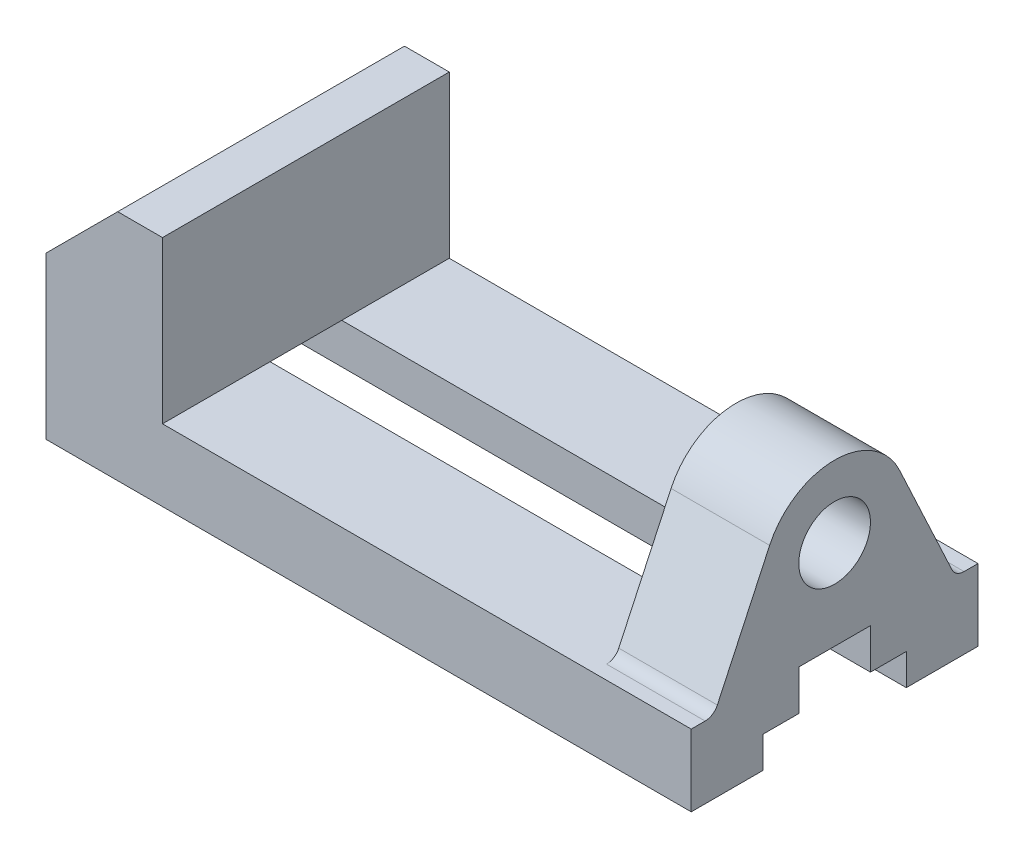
ISO-10303-21;
HEADER;
FILE_DESCRIPTION(('STEP AP214'),'2;1');
FILE_NAME('part.step','',(''),(''),'','','');
FILE_SCHEMA(('AUTOMOTIVE_DESIGN { 1 0 10303 214 1 1 1 1 }'));
ENDSEC;
DATA;
#1=APPLICATION_CONTEXT('core data for automotive mechanical design processes');
#2=APPLICATION_PROTOCOL_DEFINITION('international standard','automotive_design',2000,#1);
#3=PRODUCT_CONTEXT('',#1,'mechanical');
#4=PRODUCT('Part','Part','',(#3));
#5=PRODUCT_RELATED_PRODUCT_CATEGORY('part','',(#4));
#6=PRODUCT_DEFINITION_FORMATION('','',#4);
#7=PRODUCT_DEFINITION_CONTEXT('part definition',#1,'design');
#8=PRODUCT_DEFINITION('design','',#6,#7);
#9=PRODUCT_DEFINITION_SHAPE('','',#8);
#10=(LENGTH_UNIT() NAMED_UNIT(*) SI_UNIT(.MILLI.,.METRE.));
#11=(NAMED_UNIT(*) PLANE_ANGLE_UNIT() SI_UNIT($,.RADIAN.));
#12=(NAMED_UNIT(*) SI_UNIT($,.STERADIAN.) SOLID_ANGLE_UNIT());
#13=UNCERTAINTY_MEASURE_WITH_UNIT(LENGTH_MEASURE(1.E-05),#10,'distance_accuracy_value','');
#14=(GEOMETRIC_REPRESENTATION_CONTEXT(3) GLOBAL_UNCERTAINTY_ASSIGNED_CONTEXT((#13)) GLOBAL_UNIT_ASSIGNED_CONTEXT((#10,
#11,#12)) REPRESENTATION_CONTEXT('',''));
#15=CARTESIAN_POINT('',(0.,0.,0.));
#16=DIRECTION('',(0.,0.,1.));
#17=DIRECTION('',(1.,0.,0.));
#18=AXIS2_PLACEMENT_3D('',#15,#16,#17);
#19=CARTESIAN_POINT('',(0.,0.,32.));
#20=DIRECTION('',(0.,1.,0.));
#21=DIRECTION('',(0.,0.,1.));
#22=AXIS2_PLACEMENT_3D('',#19,#20,#21);
#23=PLANE('',#22);
#24=CARTESIAN_POINT('',(106.,0.,-22.));
#25=DIRECTION('',(0.,1.,0.));
#26=DIRECTION('',(0.,0.,1.));
#27=AXIS2_PLACEMENT_3D('',#24,#25,#26);
#28=CIRCLE('',#27,3.);
#29=CARTESIAN_POINT('',(106.,0.,-19.));
#30=VERTEX_POINT('',#29);
#31=EDGE_CURVE('E221',#30,#30,#28,.T.);
#32=ORIENTED_EDGE('',*,*,#31,.T.);
#33=EDGE_LOOP('',(#32));
#34=FACE_BOUND('',#33,.T.);
#35=DIRECTION('',(0.,0.,-1.));
#36=VECTOR('',#35,1.);
#37=CARTESIAN_POINT('',(144.,0.,32.));
#38=LINE('',#37,#36);
#39=CARTESIAN_POINT('',(144.,0.,-16.));
#40=VERTEX_POINT('',#39);
#41=CARTESIAN_POINT('',(144.,0.,-32.));
#42=VERTEX_POINT('',#41);
#43=EDGE_CURVE('E375',#40,#42,#38,.T.);
#44=ORIENTED_EDGE('',*,*,#43,.F.);
#45=DIRECTION('',(1.,0.,0.));
#46=VECTOR('',#45,1.);
#47=CARTESIAN_POINT('',(0.,0.,-16.));
#48=LINE('',#47,#46);
#49=CARTESIAN_POINT('',(0.,0.,-16.));
#50=VERTEX_POINT('',#49);
#51=EDGE_CURVE('E47',#50,#40,#48,.T.);
#52=ORIENTED_EDGE('',*,*,#51,.F.);
#53=DIRECTION('',(0.,0.,-1.));
#54=VECTOR('',#53,1.);
#55=CARTESIAN_POINT('',(0.,0.,32.));
#56=LINE('',#55,#54);
#57=CARTESIAN_POINT('',(0.,0.,-32.));
#58=VERTEX_POINT('',#57);
#59=EDGE_CURVE('E379',#50,#58,#56,.T.);
#60=ORIENTED_EDGE('',*,*,#59,.T.);
#61=DIRECTION('',(1.,0.,0.));
#62=VECTOR('',#61,1.);
#63=CARTESIAN_POINT('',(0.,0.,-32.));
#64=LINE('',#63,#62);
#65=EDGE_CURVE('E328',#58,#42,#64,.T.);
#66=ORIENTED_EDGE('',*,*,#65,.T.);
#67=EDGE_LOOP('',(#44,#52,#60,#66));
#68=FACE_BOUND('',#67,.T.);
#69=CARTESIAN_POINT('',(36.,0.,-22.));
#70=DIRECTION('',(0.,1.,0.));
#71=DIRECTION('',(0.,0.,1.));
#72=AXIS2_PLACEMENT_3D('',#69,#70,#71);
#73=CIRCLE('',#72,3.);
#74=CARTESIAN_POINT('',(36.,0.,-19.));
#75=VERTEX_POINT('',#74);
#76=EDGE_CURVE('E207',#75,#75,#73,.T.);
#77=ORIENTED_EDGE('',*,*,#76,.T.);
#78=EDGE_LOOP('',(#77));
#79=FACE_BOUND('',#78,.T.);
#80=ADVANCED_FACE('F32',(#34,#68,#79),#23,.F.);
#81=CARTESIAN_POINT('',(106.,0.,22.));
#82=DIRECTION('',(0.,1.,0.));
#83=DIRECTION('',(0.,0.,1.));
#84=AXIS2_PLACEMENT_3D('',#81,#82,#83);
#85=CIRCLE('',#84,3.);
#86=CARTESIAN_POINT('',(106.,0.,25.));
#87=VERTEX_POINT('',#86);
#88=EDGE_CURVE('E227',#87,#87,#85,.T.);
#89=ORIENTED_EDGE('',*,*,#88,.T.);
#90=EDGE_LOOP('',(#89));
#91=FACE_BOUND('',#90,.T.);
#92=CARTESIAN_POINT('',(0.,0.,32.));
#93=VERTEX_POINT('',#92);
#94=CARTESIAN_POINT('',(0.,0.,16.));
#95=VERTEX_POINT('',#94);
#96=EDGE_CURVE('E380',#93,#95,#56,.T.);
#97=ORIENTED_EDGE('',*,*,#96,.T.);
#98=DIRECTION('',(1.,0.,0.));
#99=VECTOR('',#98,1.);
#100=CARTESIAN_POINT('',(0.,0.,16.));
#101=LINE('',#100,#99);
#102=CARTESIAN_POINT('',(144.,0.,16.));
#103=VERTEX_POINT('',#102);
#104=EDGE_CURVE('E270',#95,#103,#101,.T.);
#105=ORIENTED_EDGE('',*,*,#104,.T.);
#106=CARTESIAN_POINT('',(144.,0.,32.));
#107=VERTEX_POINT('',#106);
#108=EDGE_CURVE('E376',#107,#103,#38,.T.);
#109=ORIENTED_EDGE('',*,*,#108,.F.);
#110=DIRECTION('',(1.,0.,0.));
#111=VECTOR('',#110,1.);
#112=CARTESIAN_POINT('',(0.,0.,32.));
#113=LINE('',#112,#111);
#114=EDGE_CURVE('E346',#93,#107,#113,.T.);
#115=ORIENTED_EDGE('',*,*,#114,.F.);
#116=EDGE_LOOP('',(#97,#105,#109,#115));
#117=FACE_BOUND('',#116,.T.);
#118=CARTESIAN_POINT('',(36.,0.,22.));
#119=DIRECTION('',(0.,1.,0.));
#120=DIRECTION('',(0.,0.,1.));
#121=AXIS2_PLACEMENT_3D('',#118,#119,#120);
#122=CIRCLE('',#121,3.);
#123=CARTESIAN_POINT('',(36.,0.,25.));
#124=VERTEX_POINT('',#123);
#125=EDGE_CURVE('E215',#124,#124,#122,.T.);
#126=ORIENTED_EDGE('',*,*,#125,.T.);
#127=EDGE_LOOP('',(#126));
#128=FACE_BOUND('',#127,.T.);
#129=ADVANCED_FACE('F488',(#91,#117,#128),#23,.F.);
#130=CARTESIAN_POINT('',(144.,16.,32.));
#131=DIRECTION('',(0.,-1.,0.));
#132=DIRECTION('',(1.,0.,0.));
#133=AXIS2_PLACEMENT_3D('',#130,#131,#132);
#134=PLANE('',#133);
#135=DIRECTION('',(0.,0.,-1.));
#136=VECTOR('',#135,1.);
#137=CARTESIAN_POINT('',(122.,16.,26.9801998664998));
#138=LINE('',#137,#136);
#139=CARTESIAN_POINT('',(122.,16.,28.8914106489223));
#140=VERTEX_POINT('',#139);
#141=CARTESIAN_POINT('',(122.,16.,8.));
#142=VERTEX_POINT('',#141);
#143=EDGE_CURVE('E314',#140,#142,#138,.T.);
#144=ORIENTED_EDGE('',*,*,#143,.T.);
#145=DIRECTION('',(1.,0.,0.));
#146=VECTOR('',#145,1.);
#147=CARTESIAN_POINT('',(0.,16.,8.));
#148=LINE('',#147,#146);
#149=CARTESIAN_POINT('',(26.,16.,8.));
#150=VERTEX_POINT('',#149);
#151=EDGE_CURVE('E55',#150,#142,#148,.T.);
#152=ORIENTED_EDGE('',*,*,#151,.F.);
#153=DIRECTION('',(0.,0.,-1.));
#154=VECTOR('',#153,1.);
#155=CARTESIAN_POINT('',(26.,16.,32.));
#156=LINE('',#155,#154);
#157=CARTESIAN_POINT('',(26.,16.,32.));
#158=VERTEX_POINT('',#157);
#159=EDGE_CURVE('E368',#158,#150,#156,.T.);
#160=ORIENTED_EDGE('',*,*,#159,.F.);
#161=DIRECTION('',(-1.,0.,0.));
#162=VECTOR('',#161,1.);
#163=CARTESIAN_POINT('',(144.,16.,32.));
#164=LINE('',#163,#162);
#165=CARTESIAN_POINT('',(144.,16.,32.));
#166=VERTEX_POINT('',#165);
#167=EDGE_CURVE('E350',#166,#158,#164,.T.);
#168=ORIENTED_EDGE('',*,*,#167,.F.);
#169=DIRECTION('',(0.,0.,-1.));
#170=VECTOR('',#169,1.);
#171=CARTESIAN_POINT('',(144.,16.,32.));
#172=LINE('',#171,#170);
#173=CARTESIAN_POINT('',(144.,16.,28.8914106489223));
#174=VERTEX_POINT('',#173);
#175=EDGE_CURVE('E372',#166,#174,#172,.T.);
#176=ORIENTED_EDGE('',*,*,#175,.T.);
#177=DIRECTION('',(1.,0.,0.));
#178=VECTOR('',#177,1.);
#179=CARTESIAN_POINT('',(144.,16.,28.8914106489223));
#180=LINE('',#179,#178);
#181=EDGE_CURVE('E383',#174,#140,#180,.F.);
#182=ORIENTED_EDGE('',*,*,#181,.T.);
#183=EDGE_LOOP('',(#144,#152,#160,#168,#176,#182));
#184=FACE_BOUND('',#183,.T.);
#185=ADVANCED_FACE('F408',(#184),#134,.F.);
#186=CARTESIAN_POINT('',(0.,36.,32.));
#187=DIRECTION('',(1.,0.,0.));
#188=DIRECTION('',(0.,1.,0.));
#189=AXIS2_PLACEMENT_3D('',#186,#187,#188);
#190=PLANE('',#189);
#191=DIRECTION('',(0.,0.,1.));
#192=VECTOR('',#191,1.);
#193=CARTESIAN_POINT('',(0.,7.,16.));
#194=LINE('',#193,#192);
#195=CARTESIAN_POINT('',(0.,7.,8.));
#196=VERTEX_POINT('',#195);
#197=CARTESIAN_POINT('',(0.,7.,16.));
#198=VERTEX_POINT('',#197);
#199=EDGE_CURVE('E264',#196,#198,#194,.T.);
#200=ORIENTED_EDGE('',*,*,#199,.T.);
#201=DIRECTION('',(0.,-1.,0.));
#202=VECTOR('',#201,1.);
#203=CARTESIAN_POINT('',(0.,0.,16.));
#204=LINE('',#203,#202);
#205=EDGE_CURVE('E267',#198,#95,#204,.T.);
#206=ORIENTED_EDGE('',*,*,#205,.T.);
#207=ORIENTED_EDGE('',*,*,#96,.F.);
#208=DIRECTION('',(0.,-1.,0.));
#209=VECTOR('',#208,1.);
#210=CARTESIAN_POINT('',(0.,36.,32.));
#211=LINE('',#210,#209);
#212=CARTESIAN_POINT('',(0.,36.,32.));
#213=VERTEX_POINT('',#212);
#214=EDGE_CURVE('E343',#213,#93,#211,.T.);
#215=ORIENTED_EDGE('',*,*,#214,.F.);
#216=DIRECTION('',(0.,0.,-1.));
#217=VECTOR('',#216,1.);
#218=CARTESIAN_POINT('',(0.,36.,32.));
#219=LINE('',#218,#217);
#220=CARTESIAN_POINT('',(0.,36.,-32.));
#221=VERTEX_POINT('',#220);
#222=EDGE_CURVE('E358',#213,#221,#219,.T.);
#223=ORIENTED_EDGE('',*,*,#222,.T.);
#224=DIRECTION('',(0.,-1.,0.));
#225=VECTOR('',#224,1.);
#226=CARTESIAN_POINT('',(0.,36.,-32.));
#227=LINE('',#226,#225);
#228=EDGE_CURVE('E324',#221,#58,#227,.T.);
#229=ORIENTED_EDGE('',*,*,#228,.T.);
#230=ORIENTED_EDGE('',*,*,#59,.F.);
#231=DIRECTION('',(0.,1.,0.));
#232=VECTOR('',#231,1.);
#233=CARTESIAN_POINT('',(0.,0.,-16.));
#234=LINE('',#233,#232);
#235=CARTESIAN_POINT('',(0.,7.,-16.));
#236=VERTEX_POINT('',#235);
#237=EDGE_CURVE('E249',#50,#236,#234,.T.);
#238=ORIENTED_EDGE('',*,*,#237,.T.);
#239=DIRECTION('',(0.,0.,1.));
#240=VECTOR('',#239,1.);
#241=CARTESIAN_POINT('',(0.,7.,-16.));
#242=LINE('',#241,#240);
#243=CARTESIAN_POINT('',(0.,7.,-8.));
#244=VERTEX_POINT('',#243);
#245=EDGE_CURVE('E252',#236,#244,#242,.T.);
#246=ORIENTED_EDGE('',*,*,#245,.T.);
#247=DIRECTION('',(0.,1.,0.));
#248=VECTOR('',#247,1.);
#249=CARTESIAN_POINT('',(0.,7.,-8.));
#250=LINE('',#249,#248);
#251=CARTESIAN_POINT('',(0.,16.,-8.));
#252=VERTEX_POINT('',#251);
#253=EDGE_CURVE('E255',#244,#252,#250,.T.);
#254=ORIENTED_EDGE('',*,*,#253,.T.);
#255=DIRECTION('',(0.,0.,1.));
#256=VECTOR('',#255,1.);
#257=CARTESIAN_POINT('',(0.,16.,8.));
#258=LINE('',#257,#256);
#259=CARTESIAN_POINT('',(0.,16.,8.));
#260=VERTEX_POINT('',#259);
#261=EDGE_CURVE('E258',#252,#260,#258,.T.);
#262=ORIENTED_EDGE('',*,*,#261,.T.);
#263=DIRECTION('',(0.,-1.,0.));
#264=VECTOR('',#263,1.);
#265=CARTESIAN_POINT('',(0.,7.,8.));
#266=LINE('',#265,#264);
#267=EDGE_CURVE('E261',#260,#196,#266,.T.);
#268=ORIENTED_EDGE('',*,*,#267,.T.);
#269=EDGE_LOOP('',(#200,#206,#207,#215,#223,#229,#230,#238,#246,#254,#262,#268));
#270=FACE_BOUND('',#269,.T.);
#271=ADVANCED_FACE('F34',(#270),#190,.F.);
#272=CARTESIAN_POINT('',(144.,0.,32.));
#273=DIRECTION('',(-1.,0.,0.));
#274=DIRECTION('',(0.,0.,1.));
#275=AXIS2_PLACEMENT_3D('',#272,#273,#274);
#276=PLANE('',#275);
#277=CARTESIAN_POINT('',(144.,36.,0.));
#278=DIRECTION('',(1.,0.,0.));
#279=DIRECTION('',(0.,0.,-1.));
#280=AXIS2_PLACEMENT_3D('',#277,#278,#279);
#281=CIRCLE('',#280,8.);
#282=CARTESIAN_POINT('',(144.,36.,-8.));
#283=VERTEX_POINT('',#282);
#284=EDGE_CURVE('E296',#283,#283,#281,.T.);
#285=ORIENTED_EDGE('',*,*,#284,.F.);
#286=EDGE_LOOP('',(#285));
#287=FACE_BOUND('',#286,.T.);
#288=ORIENTED_EDGE('',*,*,#108,.T.);
#289=DIRECTION('',(0.,-1.,0.));
#290=VECTOR('',#289,1.);
#291=CARTESIAN_POINT('',(144.,0.,16.));
#292=LINE('',#291,#290);
#293=CARTESIAN_POINT('',(144.,7.,16.));
#294=VERTEX_POINT('',#293);
#295=EDGE_CURVE('E247',#294,#103,#292,.T.);
#296=ORIENTED_EDGE('',*,*,#295,.F.);
#297=DIRECTION('',(0.,0.,1.));
#298=VECTOR('',#297,1.);
#299=CARTESIAN_POINT('',(144.,7.,16.));
#300=LINE('',#299,#298);
#301=CARTESIAN_POINT('',(144.,7.,8.));
#302=VERTEX_POINT('',#301);
#303=EDGE_CURVE('E244',#302,#294,#300,.T.);
#304=ORIENTED_EDGE('',*,*,#303,.F.);
#305=DIRECTION('',(0.,-1.,0.));
#306=VECTOR('',#305,1.);
#307=CARTESIAN_POINT('',(144.,7.,8.));
#308=LINE('',#307,#306);
#309=CARTESIAN_POINT('',(144.,16.,8.));
#310=VERTEX_POINT('',#309);
#311=EDGE_CURVE('E241',#310,#302,#308,.T.);
#312=ORIENTED_EDGE('',*,*,#311,.F.);
#313=DIRECTION('',(0.,0.,1.));
#314=VECTOR('',#313,1.);
#315=CARTESIAN_POINT('',(144.,16.,8.));
#316=LINE('',#315,#314);
#317=CARTESIAN_POINT('',(144.,16.,-8.));
#318=VERTEX_POINT('',#317);
#319=EDGE_CURVE('E238',#318,#310,#316,.T.);
#320=ORIENTED_EDGE('',*,*,#319,.F.);
#321=DIRECTION('',(0.,1.,0.));
#322=VECTOR('',#321,1.);
#323=CARTESIAN_POINT('',(144.,7.,-8.));
#324=LINE('',#323,#322);
#325=CARTESIAN_POINT('',(144.,7.,-8.));
#326=VERTEX_POINT('',#325);
#327=EDGE_CURVE('E235',#326,#318,#324,.T.);
#328=ORIENTED_EDGE('',*,*,#327,.F.);
#329=DIRECTION('',(0.,0.,1.));
#330=VECTOR('',#329,1.);
#331=CARTESIAN_POINT('',(144.,7.,-16.));
#332=LINE('',#331,#330);
#333=CARTESIAN_POINT('',(144.,7.,-16.));
#334=VERTEX_POINT('',#333);
#335=EDGE_CURVE('E232',#334,#326,#332,.T.);
#336=ORIENTED_EDGE('',*,*,#335,.F.);
#337=DIRECTION('',(0.,1.,0.));
#338=VECTOR('',#337,1.);
#339=CARTESIAN_POINT('',(144.,0.,-16.));
#340=LINE('',#339,#338);
#341=EDGE_CURVE('E230',#40,#334,#340,.T.);
#342=ORIENTED_EDGE('',*,*,#341,.F.);
#343=ORIENTED_EDGE('',*,*,#43,.T.);
#344=DIRECTION('',(0.,1.,0.));
#345=VECTOR('',#344,1.);
#346=CARTESIAN_POINT('',(144.,0.,-32.));
#347=LINE('',#346,#345);
#348=CARTESIAN_POINT('',(144.,16.,-32.));
#349=VERTEX_POINT('',#348);
#350=EDGE_CURVE('E331',#42,#349,#347,.T.);
#351=ORIENTED_EDGE('',*,*,#350,.T.);
#352=CARTESIAN_POINT('',(144.,16.,-28.8914106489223));
#353=VERTEX_POINT('',#352);
#354=EDGE_CURVE('E371',#353,#349,#172,.T.);
#355=ORIENTED_EDGE('',*,*,#354,.F.);
#356=CARTESIAN_POINT('',(144.,19.,-28.8914106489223));
#357=DIRECTION('',(-1.,0.,0.));
#358=DIRECTION('',(0.,0.,1.));
#359=AXIS2_PLACEMENT_3D('',#356,#357,#358);
#360=CIRCLE('',#359,3.);
#361=CARTESIAN_POINT('',(144.,17.7321452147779,-26.1724872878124));
#362=VERTEX_POINT('',#361);
#363=EDGE_CURVE('E394',#353,#362,#360,.T.);
#364=ORIENTED_EDGE('',*,*,#363,.T.);
#365=DIRECTION('',(0.,0.906307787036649,0.4226182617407));
#366=VECTOR('',#365,1.);
#367=CARTESIAN_POINT('',(144.,42.7618921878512,-14.5009245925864));
#368=LINE('',#367,#366);
#369=CARTESIAN_POINT('',(144.,42.7618921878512,-14.5009245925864));
#370=VERTEX_POINT('',#369);
#371=EDGE_CURVE('E305',#362,#370,#368,.T.);
#372=ORIENTED_EDGE('',*,*,#371,.T.);
#373=CARTESIAN_POINT('',(144.,36.,0.));
#374=DIRECTION('',(1.,0.,0.));
#375=DIRECTION('',(0.,0.,-1.));
#376=AXIS2_PLACEMENT_3D('',#373,#374,#375);
#377=CIRCLE('',#376,16.);
#378=CARTESIAN_POINT('',(144.,42.7618921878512,14.5009245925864));
#379=VERTEX_POINT('',#378);
#380=EDGE_CURVE('E299',#370,#379,#377,.T.);
#381=ORIENTED_EDGE('',*,*,#380,.T.);
#382=DIRECTION('',(0.,-0.90630778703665,0.4226182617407));
#383=VECTOR('',#382,1.);
#384=CARTESIAN_POINT('',(144.,42.7618921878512,14.5009245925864));
#385=LINE('',#384,#383);
#386=CARTESIAN_POINT('',(144.,17.7321452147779,26.1724872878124));
#387=VERTEX_POINT('',#386);
#388=EDGE_CURVE('E302',#379,#387,#385,.T.);
#389=ORIENTED_EDGE('',*,*,#388,.T.);
#390=CARTESIAN_POINT('',(144.,19.,28.8914106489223));
#391=DIRECTION('',(-1.,0.,0.));
#392=DIRECTION('',(0.,0.,1.));
#393=AXIS2_PLACEMENT_3D('',#390,#391,#392);
#394=CIRCLE('',#393,3.);
#395=EDGE_CURVE('E40',#387,#174,#394,.T.);
#396=ORIENTED_EDGE('',*,*,#395,.T.);
#397=ORIENTED_EDGE('',*,*,#175,.F.);
#398=DIRECTION('',(0.,1.,0.));
#399=VECTOR('',#398,1.);
#400=CARTESIAN_POINT('',(144.,0.,32.));
#401=LINE('',#400,#399);
#402=EDGE_CURVE('E348',#107,#166,#401,.T.);
#403=ORIENTED_EDGE('',*,*,#402,.F.);
#404=EDGE_LOOP('',(#288,#296,#304,#312,#320,#328,#336,#342,#343,#351,#355,#364,#372,#381,#389,
#396,#397,#403));
#405=FACE_BOUND('',#404,.T.);
#406=ADVANCED_FACE('F400',(#287,#405),#276,.F.);
#407=CARTESIAN_POINT('',(26.,16.,-8.));
#408=VERTEX_POINT('',#407);
#409=CARTESIAN_POINT('',(26.,16.,-32.));
#410=VERTEX_POINT('',#409);
#411=EDGE_CURVE('E367',#408,#410,#156,.T.);
#412=ORIENTED_EDGE('',*,*,#411,.F.);
#413=DIRECTION('',(1.,0.,0.));
#414=VECTOR('',#413,1.);
#415=CARTESIAN_POINT('',(0.,16.,-8.));
#416=LINE('',#415,#414);
#417=CARTESIAN_POINT('',(122.,16.,-8.));
#418=VERTEX_POINT('',#417);
#419=EDGE_CURVE('E284',#408,#418,#416,.T.);
#420=ORIENTED_EDGE('',*,*,#419,.T.);
#421=CARTESIAN_POINT('',(122.,16.,-28.8914106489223));
#422=VERTEX_POINT('',#421);
#423=EDGE_CURVE('E313',#418,#422,#138,.T.);
#424=ORIENTED_EDGE('',*,*,#423,.T.);
#425=DIRECTION('',(1.,0.,0.));
#426=VECTOR('',#425,1.);
#427=CARTESIAN_POINT('',(144.,16.,-28.8914106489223));
#428=LINE('',#427,#426);
#429=EDGE_CURVE('E386',#422,#353,#428,.T.);
#430=ORIENTED_EDGE('',*,*,#429,.T.);
#431=ORIENTED_EDGE('',*,*,#354,.T.);
#432=DIRECTION('',(-1.,0.,0.));
#433=VECTOR('',#432,1.);
#434=CARTESIAN_POINT('',(144.,16.,-32.));
#435=LINE('',#434,#433);
#436=EDGE_CURVE('E334',#349,#410,#435,.T.);
#437=ORIENTED_EDGE('',*,*,#436,.T.);
#438=EDGE_LOOP('',(#412,#420,#424,#430,#431,#437));
#439=FACE_BOUND('',#438,.T.);
#440=ADVANCED_FACE('F434',(#439),#134,.F.);
#441=CARTESIAN_POINT('',(26.,16.,32.));
#442=DIRECTION('',(-1.,0.,0.));
#443=DIRECTION('',(0.,-1.,0.));
#444=AXIS2_PLACEMENT_3D('',#441,#442,#443);
#445=PLANE('',#444);
#446=DIRECTION('',(0.,1.,0.));
#447=VECTOR('',#446,1.);
#448=CARTESIAN_POINT('',(26.,16.,-32.));
#449=LINE('',#448,#447);
#450=CARTESIAN_POINT('',(26.,52.,-32.));
#451=VERTEX_POINT('',#450);
#452=EDGE_CURVE('E337',#410,#451,#449,.T.);
#453=ORIENTED_EDGE('',*,*,#452,.T.);
#454=DIRECTION('',(0.,0.,-1.));
#455=VECTOR('',#454,1.);
#456=CARTESIAN_POINT('',(26.,52.,32.));
#457=LINE('',#456,#455);
#458=CARTESIAN_POINT('',(26.,52.,32.));
#459=VERTEX_POINT('',#458);
#460=EDGE_CURVE('E364',#459,#451,#457,.T.);
#461=ORIENTED_EDGE('',*,*,#460,.F.);
#462=DIRECTION('',(0.,1.,0.));
#463=VECTOR('',#462,1.);
#464=CARTESIAN_POINT('',(26.,16.,32.));
#465=LINE('',#464,#463);
#466=EDGE_CURVE('E352',#158,#459,#465,.T.);
#467=ORIENTED_EDGE('',*,*,#466,.F.);
#468=ORIENTED_EDGE('',*,*,#159,.T.);
#469=DIRECTION('',(0.,0.,-1.));
#470=VECTOR('',#469,1.);
#471=CARTESIAN_POINT('',(26.,16.,32.));
#472=LINE('',#471,#470);
#473=EDGE_CURVE('E273',#150,#408,#472,.T.);
#474=ORIENTED_EDGE('',*,*,#473,.T.);
#475=ORIENTED_EDGE('',*,*,#411,.T.);
#476=EDGE_LOOP('',(#453,#461,#467,#468,#474,#475));
#477=FACE_BOUND('',#476,.T.);
#478=ADVANCED_FACE('F447',(#477),#445,.F.);
#479=CARTESIAN_POINT('',(26.,52.,32.));
#480=DIRECTION('',(0.,-1.,0.));
#481=DIRECTION('',(0.,0.,-1.));
#482=AXIS2_PLACEMENT_3D('',#479,#480,#481);
#483=PLANE('',#482);
#484=DIRECTION('',(-1.,0.,0.));
#485=VECTOR('',#484,1.);
#486=CARTESIAN_POINT('',(26.,52.,-32.));
#487=LINE('',#486,#485);
#488=CARTESIAN_POINT('',(16.,52.,-32.));
#489=VERTEX_POINT('',#488);
#490=EDGE_CURVE('E339',#451,#489,#487,.T.);
#491=ORIENTED_EDGE('',*,*,#490,.T.);
#492=DIRECTION('',(0.,0.,-1.));
#493=VECTOR('',#492,1.);
#494=CARTESIAN_POINT('',(16.,52.,32.));
#495=LINE('',#494,#493);
#496=CARTESIAN_POINT('',(16.,52.,32.));
#497=VERTEX_POINT('',#496);
#498=EDGE_CURVE('E361',#497,#489,#495,.T.);
#499=ORIENTED_EDGE('',*,*,#498,.F.);
#500=DIRECTION('',(-1.,0.,0.));
#501=VECTOR('',#500,1.);
#502=CARTESIAN_POINT('',(26.,52.,32.));
#503=LINE('',#502,#501);
#504=EDGE_CURVE('E354',#459,#497,#503,.T.);
#505=ORIENTED_EDGE('',*,*,#504,.F.);
#506=ORIENTED_EDGE('',*,*,#460,.T.);
#507=EDGE_LOOP('',(#491,#499,#505,#506));
#508=FACE_BOUND('',#507,.T.);
#509=ADVANCED_FACE('F503',(#508),#483,.F.);
#510=CARTESIAN_POINT('',(16.,52.,32.));
#511=DIRECTION('',(0.707106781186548,-0.707106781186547,0.));
#512=DIRECTION('',(0.707106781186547,0.707106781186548,0.));
#513=AXIS2_PLACEMENT_3D('',#510,#511,#512);
#514=PLANE('',#513);
#515=DIRECTION('',(-0.707106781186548,-0.707106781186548,0.));
#516=VECTOR('',#515,1.);
#517=CARTESIAN_POINT('',(16.,52.,-32.));
#518=LINE('',#517,#516);
#519=EDGE_CURVE('E341',#489,#221,#518,.T.);
#520=ORIENTED_EDGE('',*,*,#519,.T.);
#521=ORIENTED_EDGE('',*,*,#222,.F.);
#522=DIRECTION('',(-0.707106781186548,-0.707106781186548,0.));
#523=VECTOR('',#522,1.);
#524=CARTESIAN_POINT('',(16.,52.,32.));
#525=LINE('',#524,#523);
#526=EDGE_CURVE('E356',#497,#213,#525,.T.);
#527=ORIENTED_EDGE('',*,*,#526,.F.);
#528=ORIENTED_EDGE('',*,*,#498,.T.);
#529=EDGE_LOOP('',(#520,#521,#527,#528));
#530=FACE_BOUND('',#529,.T.);
#531=ADVANCED_FACE('F506',(#530),#514,.F.);
#532=CARTESIAN_POINT('',(0.,0.,32.));
#533=DIRECTION('',(0.,0.,1.));
#534=DIRECTION('',(1.,0.,0.));
#535=AXIS2_PLACEMENT_3D('',#532,#533,#534);
#536=PLANE('',#535);
#537=ORIENTED_EDGE('',*,*,#214,.T.);
#538=ORIENTED_EDGE('',*,*,#114,.T.);
#539=ORIENTED_EDGE('',*,*,#402,.T.);
#540=ORIENTED_EDGE('',*,*,#167,.T.);
#541=ORIENTED_EDGE('',*,*,#466,.T.);
#542=ORIENTED_EDGE('',*,*,#504,.T.);
#543=ORIENTED_EDGE('',*,*,#526,.T.);
#544=EDGE_LOOP('',(#537,#538,#539,#540,#541,#542,#543));
#545=FACE_BOUND('',#544,.T.);
#546=ADVANCED_FACE('F510',(#545),#536,.T.);
#547=CARTESIAN_POINT('',(0.,0.,-32.));
#548=DIRECTION('',(0.,0.,1.));
#549=DIRECTION('',(1.,0.,0.));
#550=AXIS2_PLACEMENT_3D('',#547,#548,#549);
#551=PLANE('',#550);
#552=ORIENTED_EDGE('',*,*,#228,.F.);
#553=ORIENTED_EDGE('',*,*,#519,.F.);
#554=ORIENTED_EDGE('',*,*,#490,.F.);
#555=ORIENTED_EDGE('',*,*,#452,.F.);
#556=ORIENTED_EDGE('',*,*,#436,.F.);
#557=ORIENTED_EDGE('',*,*,#350,.F.);
#558=ORIENTED_EDGE('',*,*,#65,.F.);
#559=EDGE_LOOP('',(#552,#553,#554,#555,#556,#557,#558));
#560=FACE_BOUND('',#559,.T.);
#561=ADVANCED_FACE('F444',(#560),#551,.F.);
#562=CARTESIAN_POINT('',(122.,36.,0.));
#563=DIRECTION('',(1.,0.,0.));
#564=DIRECTION('',(0.,0.,-1.));
#565=AXIS2_PLACEMENT_3D('',#562,#563,#564);
#566=CYLINDRICAL_SURFACE('',#565,16.);
#567=ORIENTED_EDGE('',*,*,#380,.F.);
#568=DIRECTION('',(1.,0.,0.));
#569=VECTOR('',#568,1.);
#570=CARTESIAN_POINT('',(122.,42.7618921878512,-14.5009245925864));
#571=LINE('',#570,#569);
#572=CARTESIAN_POINT('',(122.,42.7618921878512,-14.5009245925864));
#573=VERTEX_POINT('',#572);
#574=EDGE_CURVE('E321',#573,#370,#571,.T.);
#575=ORIENTED_EDGE('',*,*,#574,.F.);
#576=CARTESIAN_POINT('',(122.,36.,0.));
#577=DIRECTION('',(1.,0.,0.));
#578=DIRECTION('',(0.,0.,-1.));
#579=AXIS2_PLACEMENT_3D('',#576,#577,#578);
#580=CIRCLE('',#579,16.);
#581=CARTESIAN_POINT('',(122.,42.7618921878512,14.5009245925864));
#582=VERTEX_POINT('',#581);
#583=EDGE_CURVE('E307',#573,#582,#580,.T.);
#584=ORIENTED_EDGE('',*,*,#583,.T.);
#585=DIRECTION('',(1.,0.,0.));
#586=VECTOR('',#585,1.);
#587=CARTESIAN_POINT('',(122.,42.7618921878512,14.5009245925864));
#588=LINE('',#587,#586);
#589=EDGE_CURVE('E320',#582,#379,#588,.T.);
#590=ORIENTED_EDGE('',*,*,#589,.T.);
#591=EDGE_LOOP('',(#567,#575,#584,#590));
#592=FACE_BOUND('',#591,.T.);
#593=ADVANCED_FACE('F421',(#592),#566,.T.);
#594=CARTESIAN_POINT('',(122.,42.7618921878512,-14.5009245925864));
#595=DIRECTION('',(0.,0.4226182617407,-0.90630778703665));
#596=DIRECTION('',(0.,0.90630778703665,0.4226182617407));
#597=AXIS2_PLACEMENT_3D('',#594,#595,#596);
#598=PLANE('',#597);
#599=ORIENTED_EDGE('',*,*,#371,.F.);
#600=DIRECTION('',(1.,0.,0.));
#601=VECTOR('',#600,1.);
#602=CARTESIAN_POINT('',(122.,17.7321452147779,-26.1724872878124));
#603=LINE('',#602,#601);
#604=CARTESIAN_POINT('',(122.,17.7321452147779,-26.1724872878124));
#605=VERTEX_POINT('',#604);
#606=EDGE_CURVE('E389',#362,#605,#603,.F.);
#607=ORIENTED_EDGE('',*,*,#606,.T.);
#608=DIRECTION('',(0.,0.906307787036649,0.4226182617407));
#609=VECTOR('',#608,1.);
#610=CARTESIAN_POINT('',(122.,42.7618921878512,-14.5009245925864));
#611=LINE('',#610,#609);
#612=EDGE_CURVE('E317',#605,#573,#611,.T.);
#613=ORIENTED_EDGE('',*,*,#612,.T.);
#614=ORIENTED_EDGE('',*,*,#574,.T.);
#615=EDGE_LOOP('',(#599,#607,#613,#614));
#616=FACE_BOUND('',#615,.T.);
#617=ADVANCED_FACE('F519',(#616),#598,.T.);
#618=CARTESIAN_POINT('',(122.,42.7618921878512,14.5009245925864));
#619=DIRECTION('',(0.,0.4226182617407,0.90630778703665));
#620=DIRECTION('',(0.,-0.90630778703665,0.4226182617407));
#621=AXIS2_PLACEMENT_3D('',#618,#619,#620);
#622=PLANE('',#621);
#623=DIRECTION('',(0.,-0.90630778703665,0.4226182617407));
#624=VECTOR('',#623,1.);
#625=CARTESIAN_POINT('',(122.,42.7618921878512,14.5009245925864));
#626=LINE('',#625,#624);
#627=CARTESIAN_POINT('',(122.,17.7321452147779,26.1724872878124));
#628=VERTEX_POINT('',#627);
#629=EDGE_CURVE('E310',#582,#628,#626,.T.);
#630=ORIENTED_EDGE('',*,*,#629,.T.);
#631=DIRECTION('',(1.,0.,0.));
#632=VECTOR('',#631,1.);
#633=CARTESIAN_POINT('',(122.,17.7321452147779,26.1724872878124));
#634=LINE('',#633,#632);
#635=EDGE_CURVE('E391',#628,#387,#634,.T.);
#636=ORIENTED_EDGE('',*,*,#635,.T.);
#637=ORIENTED_EDGE('',*,*,#388,.F.);
#638=ORIENTED_EDGE('',*,*,#589,.F.);
#639=EDGE_LOOP('',(#630,#636,#637,#638));
#640=FACE_BOUND('',#639,.T.);
#641=ADVANCED_FACE('F418',(#640),#622,.T.);
#642=CARTESIAN_POINT('',(122.,36.,0.));
#643=DIRECTION('',(1.,0.,0.));
#644=DIRECTION('',(0.,0.,-1.));
#645=AXIS2_PLACEMENT_3D('',#642,#643,#644);
#646=PLANE('',#645);
#647=CARTESIAN_POINT('',(122.,36.,0.));
#648=DIRECTION('',(1.,0.,0.));
#649=DIRECTION('',(0.,0.,-1.));
#650=AXIS2_PLACEMENT_3D('',#647,#648,#649);
#651=CIRCLE('',#650,8.);
#652=CARTESIAN_POINT('',(122.,36.,-8.));
#653=VERTEX_POINT('',#652);
#654=EDGE_CURVE('E293',#653,#653,#651,.F.);
#655=ORIENTED_EDGE('',*,*,#654,.F.);
#656=EDGE_LOOP('',(#655));
#657=FACE_BOUND('',#656,.T.);
#658=ORIENTED_EDGE('',*,*,#583,.F.);
#659=ORIENTED_EDGE('',*,*,#612,.F.);
#660=CARTESIAN_POINT('',(122.,19.,-28.8914106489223));
#661=DIRECTION('',(1.,0.,0.));
#662=DIRECTION('',(0.,0.,-1.));
#663=AXIS2_PLACEMENT_3D('',#660,#661,#662);
#664=CIRCLE('',#663,3.);
#665=EDGE_CURVE('E396',#605,#422,#664,.T.);
#666=ORIENTED_EDGE('',*,*,#665,.T.);
#667=ORIENTED_EDGE('',*,*,#423,.F.);
#668=EDGE_CURVE('E318',#142,#418,#138,.T.);
#669=ORIENTED_EDGE('',*,*,#668,.F.);
#670=ORIENTED_EDGE('',*,*,#143,.F.);
#671=CARTESIAN_POINT('',(122.,19.,28.8914106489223));
#672=DIRECTION('',(1.,0.,0.));
#673=DIRECTION('',(0.,0.,-1.));
#674=AXIS2_PLACEMENT_3D('',#671,#672,#673);
#675=CIRCLE('',#674,3.);
#676=EDGE_CURVE('E11',#140,#628,#675,.T.);
#677=ORIENTED_EDGE('',*,*,#676,.T.);
#678=ORIENTED_EDGE('',*,*,#629,.F.);
#679=EDGE_LOOP('',(#658,#659,#666,#667,#669,#670,#677,#678));
#680=FACE_BOUND('',#679,.T.);
#681=ADVANCED_FACE('F415',(#657,#680),#646,.F.);
#682=CARTESIAN_POINT('',(144.,19.,-28.8914106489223));
#683=DIRECTION('',(1.,0.,0.));
#684=DIRECTION('',(0.,1.,0.));
#685=AXIS2_PLACEMENT_3D('',#682,#683,#684);
#686=CYLINDRICAL_SURFACE('',#685,3.);
#687=ORIENTED_EDGE('',*,*,#665,.F.);
#688=ORIENTED_EDGE('',*,*,#606,.F.);
#689=ORIENTED_EDGE('',*,*,#363,.F.);
#690=ORIENTED_EDGE('',*,*,#429,.F.);
#691=EDGE_LOOP('',(#687,#688,#689,#690));
#692=FACE_BOUND('',#691,.T.);
#693=ADVANCED_FACE('F430',(#692),#686,.F.);
#694=CARTESIAN_POINT('',(122.,19.,28.8914106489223));
#695=DIRECTION('',(1.,0.,0.));
#696=DIRECTION('',(0.,1.,0.));
#697=AXIS2_PLACEMENT_3D('',#694,#695,#696);
#698=CYLINDRICAL_SURFACE('',#697,3.);
#699=ORIENTED_EDGE('',*,*,#676,.F.);
#700=ORIENTED_EDGE('',*,*,#181,.F.);
#701=ORIENTED_EDGE('',*,*,#395,.F.);
#702=ORIENTED_EDGE('',*,*,#635,.F.);
#703=EDGE_LOOP('',(#699,#700,#701,#702));
#704=FACE_BOUND('',#703,.T.);
#705=ADVANCED_FACE('F411',(#704),#698,.F.);
#706=CARTESIAN_POINT('',(-0.001000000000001,36.,0.));
#707=DIRECTION('',(1.,0.,0.));
#708=DIRECTION('',(0.,0.,-1.));
#709=AXIS2_PLACEMENT_3D('',#706,#707,#708);
#710=CYLINDRICAL_SURFACE('',#709,8.);
#711=ORIENTED_EDGE('',*,*,#284,.T.);
#712=EDGE_LOOP('',(#711));
#713=FACE_BOUND('',#712,.T.);
#714=ORIENTED_EDGE('',*,*,#654,.T.);
#715=EDGE_LOOP('',(#714));
#716=FACE_BOUND('',#715,.T.);
#717=ADVANCED_FACE('F530',(#713,#716),#710,.F.);
#718=CARTESIAN_POINT('',(0.,16.,8.));
#719=DIRECTION('',(0.,1.,0.));
#720=DIRECTION('',(0.,0.,1.));
#721=AXIS2_PLACEMENT_3D('',#718,#719,#720);
#722=PLANE('',#721);
#723=EDGE_CURVE('E278',#260,#150,#148,.T.);
#724=ORIENTED_EDGE('',*,*,#723,.F.);
#725=ORIENTED_EDGE('',*,*,#261,.F.);
#726=EDGE_CURVE('E281',#252,#408,#416,.T.);
#727=ORIENTED_EDGE('',*,*,#726,.T.);
#728=ORIENTED_EDGE('',*,*,#473,.F.);
#729=EDGE_LOOP('',(#724,#725,#727,#728));
#730=FACE_BOUND('',#729,.T.);
#731=ADVANCED_FACE('F450',(#730),#722,.F.);
#732=EDGE_CURVE('E285',#418,#318,#416,.T.);
#733=ORIENTED_EDGE('',*,*,#732,.T.);
#734=ORIENTED_EDGE('',*,*,#319,.T.);
#735=EDGE_CURVE('E280',#142,#310,#148,.T.);
#736=ORIENTED_EDGE('',*,*,#735,.F.);
#737=ORIENTED_EDGE('',*,*,#668,.T.);
#738=EDGE_LOOP('',(#733,#734,#736,#737));
#739=FACE_BOUND('',#738,.T.);
#740=ADVANCED_FACE('F458',(#739),#722,.F.);
#741=CARTESIAN_POINT('',(0.,0.,16.));
#742=DIRECTION('',(0.,0.,1.));
#743=DIRECTION('',(1.,0.,0.));
#744=AXIS2_PLACEMENT_3D('',#741,#742,#743);
#745=PLANE('',#744);
#746=ORIENTED_EDGE('',*,*,#295,.T.);
#747=ORIENTED_EDGE('',*,*,#104,.F.);
#748=ORIENTED_EDGE('',*,*,#205,.F.);
#749=DIRECTION('',(1.,0.,0.));
#750=VECTOR('',#749,1.);
#751=CARTESIAN_POINT('',(0.,7.,16.));
#752=LINE('',#751,#750);
#753=EDGE_CURVE('E274',#198,#294,#752,.T.);
#754=ORIENTED_EDGE('',*,*,#753,.T.);
#755=EDGE_LOOP('',(#746,#747,#748,#754));
#756=FACE_BOUND('',#755,.T.);
#757=ADVANCED_FACE('F543',(#756),#745,.F.);
#758=CARTESIAN_POINT('',(0.,7.,16.));
#759=DIRECTION('',(0.,1.,0.));
#760=DIRECTION('',(0.,0.,1.));
#761=AXIS2_PLACEMENT_3D('',#758,#759,#760);
#762=PLANE('',#761);
#763=ORIENTED_EDGE('',*,*,#303,.T.);
#764=ORIENTED_EDGE('',*,*,#753,.F.);
#765=ORIENTED_EDGE('',*,*,#199,.F.);
#766=DIRECTION('',(1.,0.,0.));
#767=VECTOR('',#766,1.);
#768=CARTESIAN_POINT('',(0.,7.,8.));
#769=LINE('',#768,#767);
#770=EDGE_CURVE('E276',#196,#302,#769,.T.);
#771=ORIENTED_EDGE('',*,*,#770,.T.);
#772=EDGE_LOOP('',(#763,#764,#765,#771));
#773=FACE_BOUND('',#772,.T.);
#774=ADVANCED_FACE('F463',(#773),#762,.F.);
#775=CARTESIAN_POINT('',(0.,7.,8.));
#776=DIRECTION('',(0.,0.,1.));
#777=DIRECTION('',(1.,0.,0.));
#778=AXIS2_PLACEMENT_3D('',#775,#776,#777);
#779=PLANE('',#778);
#780=ORIENTED_EDGE('',*,*,#311,.T.);
#781=ORIENTED_EDGE('',*,*,#770,.F.);
#782=ORIENTED_EDGE('',*,*,#267,.F.);
#783=ORIENTED_EDGE('',*,*,#723,.T.);
#784=ORIENTED_EDGE('',*,*,#151,.T.);
#785=ORIENTED_EDGE('',*,*,#735,.T.);
#786=EDGE_LOOP('',(#780,#781,#782,#783,#784,#785));
#787=FACE_BOUND('',#786,.T.);
#788=ADVANCED_FACE('F453',(#787),#779,.F.);
#789=CARTESIAN_POINT('',(0.,7.,-8.));
#790=DIRECTION('',(0.,0.,-1.));
#791=DIRECTION('',(-1.,0.,0.));
#792=AXIS2_PLACEMENT_3D('',#789,#790,#791);
#793=PLANE('',#792);
#794=ORIENTED_EDGE('',*,*,#327,.T.);
#795=ORIENTED_EDGE('',*,*,#732,.F.);
#796=ORIENTED_EDGE('',*,*,#419,.F.);
#797=ORIENTED_EDGE('',*,*,#726,.F.);
#798=ORIENTED_EDGE('',*,*,#253,.F.);
#799=DIRECTION('',(1.,0.,0.));
#800=VECTOR('',#799,1.);
#801=CARTESIAN_POINT('',(0.,7.,-8.));
#802=LINE('',#801,#800);
#803=EDGE_CURVE('E286',#244,#326,#802,.T.);
#804=ORIENTED_EDGE('',*,*,#803,.T.);
#805=EDGE_LOOP('',(#794,#795,#796,#797,#798,#804));
#806=FACE_BOUND('',#805,.T.);
#807=ADVANCED_FACE('F470',(#806),#793,.F.);
#808=CARTESIAN_POINT('',(0.,7.,-16.));
#809=DIRECTION('',(0.,1.,0.));
#810=DIRECTION('',(0.,0.,1.));
#811=AXIS2_PLACEMENT_3D('',#808,#809,#810);
#812=PLANE('',#811);
#813=ORIENTED_EDGE('',*,*,#335,.T.);
#814=ORIENTED_EDGE('',*,*,#803,.F.);
#815=ORIENTED_EDGE('',*,*,#245,.F.);
#816=DIRECTION('',(1.,0.,0.));
#817=VECTOR('',#816,1.);
#818=CARTESIAN_POINT('',(0.,7.,-16.));
#819=LINE('',#818,#817);
#820=EDGE_CURVE('E288',#236,#334,#819,.T.);
#821=ORIENTED_EDGE('',*,*,#820,.T.);
#822=EDGE_LOOP('',(#813,#814,#815,#821));
#823=FACE_BOUND('',#822,.T.);
#824=ADVANCED_FACE('F473',(#823),#812,.F.);
#825=CARTESIAN_POINT('',(0.,0.,-16.));
#826=DIRECTION('',(0.,0.,-1.));
#827=DIRECTION('',(-1.,0.,0.));
#828=AXIS2_PLACEMENT_3D('',#825,#826,#827);
#829=PLANE('',#828);
#830=ORIENTED_EDGE('',*,*,#341,.T.);
#831=ORIENTED_EDGE('',*,*,#820,.F.);
#832=ORIENTED_EDGE('',*,*,#237,.F.);
#833=ORIENTED_EDGE('',*,*,#51,.T.);
#834=EDGE_LOOP('',(#830,#831,#832,#833));
#835=FACE_BOUND('',#834,.T.);
#836=ADVANCED_FACE('F474',(#835),#829,.F.);
#837=CARTESIAN_POINT('',(106.,26.4839292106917,22.));
#838=DIRECTION('',(0.,1.,0.));
#839=DIRECTION('',(0.,0.,1.));
#840=AXIS2_PLACEMENT_3D('',#837,#838,#839);
#841=CYLINDRICAL_SURFACE('',#840,3.);
#842=CARTESIAN_POINT('',(106.,10.,22.));
#843=DIRECTION('',(0.,1.,0.));
#844=DIRECTION('',(0.,0.,1.));
#845=AXIS2_PLACEMENT_3D('',#842,#843,#844);
#846=CIRCLE('',#845,3.);
#847=CARTESIAN_POINT('',(106.,10.,25.));
#848=VERTEX_POINT('',#847);
#849=EDGE_CURVE('E224',#848,#848,#846,.T.);
#850=ORIENTED_EDGE('',*,*,#849,.T.);
#851=EDGE_LOOP('',(#850));
#852=FACE_BOUND('',#851,.T.);
#853=ORIENTED_EDGE('',*,*,#88,.F.);
#854=EDGE_LOOP('',(#853));
#855=FACE_BOUND('',#854,.T.);
#856=ADVANCED_FACE('F476',(#852,#855),#841,.F.);
#857=CARTESIAN_POINT('',(106.,10.,22.));
#858=DIRECTION('',(0.,-1.,0.));
#859=DIRECTION('',(0.,0.,-1.));
#860=AXIS2_PLACEMENT_3D('',#857,#858,#859);
#861=CONICAL_SURFACE('',#860,3.,1.04719755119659);
#862=CARTESIAN_POINT('',(106.,11.7320508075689,22.));
#863=VERTEX_POINT('',#862);
#864=VERTEX_LOOP('',#863);
#865=FACE_BOUND('',#864,.T.);
#866=ORIENTED_EDGE('',*,*,#849,.F.);
#867=EDGE_LOOP('',(#866));
#868=FACE_BOUND('',#867,.T.);
#869=ADVANCED_FACE('F482',(#865,#868),#861,.F.);
#870=CARTESIAN_POINT('',(106.,26.4839292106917,-22.));
#871=DIRECTION('',(0.,1.,0.));
#872=DIRECTION('',(0.,0.,1.));
#873=AXIS2_PLACEMENT_3D('',#870,#871,#872);
#874=CYLINDRICAL_SURFACE('',#873,3.);
#875=CARTESIAN_POINT('',(106.,10.,-22.));
#876=DIRECTION('',(0.,1.,0.));
#877=DIRECTION('',(0.,0.,1.));
#878=AXIS2_PLACEMENT_3D('',#875,#876,#877);
#879=CIRCLE('',#878,3.);
#880=CARTESIAN_POINT('',(106.,10.,-19.));
#881=VERTEX_POINT('',#880);
#882=EDGE_CURVE('E218',#881,#881,#879,.T.);
#883=ORIENTED_EDGE('',*,*,#882,.T.);
#884=EDGE_LOOP('',(#883));
#885=FACE_BOUND('',#884,.T.);
#886=ORIENTED_EDGE('',*,*,#31,.F.);
#887=EDGE_LOOP('',(#886));
#888=FACE_BOUND('',#887,.T.);
#889=ADVANCED_FACE('F562',(#885,#888),#874,.F.);
#890=CARTESIAN_POINT('',(106.,10.,-22.));
#891=DIRECTION('',(0.,-1.,0.));
#892=DIRECTION('',(0.,0.,-1.));
#893=AXIS2_PLACEMENT_3D('',#890,#891,#892);
#894=CONICAL_SURFACE('',#893,3.,1.04719755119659);
#895=CARTESIAN_POINT('',(106.,11.7320508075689,-22.));
#896=VERTEX_POINT('',#895);
#897=VERTEX_LOOP('',#896);
#898=FACE_BOUND('',#897,.T.);
#899=ORIENTED_EDGE('',*,*,#882,.F.);
#900=EDGE_LOOP('',(#899));
#901=FACE_BOUND('',#900,.T.);
#902=ADVANCED_FACE('F566',(#898,#901),#894,.F.);
#903=CARTESIAN_POINT('',(36.,26.4839292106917,22.));
#904=DIRECTION('',(0.,1.,0.));
#905=DIRECTION('',(0.,0.,1.));
#906=AXIS2_PLACEMENT_3D('',#903,#904,#905);
#907=CYLINDRICAL_SURFACE('',#906,3.);
#908=CARTESIAN_POINT('',(36.,9.99999999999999,22.));
#909=DIRECTION('',(0.,1.,0.));
#910=DIRECTION('',(0.,0.,1.));
#911=AXIS2_PLACEMENT_3D('',#908,#909,#910);
#912=CIRCLE('',#911,3.);
#913=CARTESIAN_POINT('',(36.,9.99999999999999,25.));
#914=VERTEX_POINT('',#913);
#915=EDGE_CURVE('E210',#914,#914,#912,.T.);
#916=ORIENTED_EDGE('',*,*,#915,.T.);
#917=EDGE_LOOP('',(#916));
#918=FACE_BOUND('',#917,.T.);
#919=ORIENTED_EDGE('',*,*,#125,.F.);
#920=EDGE_LOOP('',(#919));
#921=FACE_BOUND('',#920,.T.);
#922=ADVANCED_FACE('F570',(#918,#921),#907,.F.);
#923=CARTESIAN_POINT('',(36.,9.99999999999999,22.));
#924=DIRECTION('',(0.,-1.,0.));
#925=DIRECTION('',(0.,0.,-1.));
#926=AXIS2_PLACEMENT_3D('',#923,#924,#925);
#927=CONICAL_SURFACE('',#926,3.,1.04719755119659);
#928=CARTESIAN_POINT('',(36.,11.7320508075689,22.));
#929=VERTEX_POINT('',#928);
#930=VERTEX_LOOP('',#929);
#931=FACE_BOUND('',#930,.T.);
#932=ORIENTED_EDGE('',*,*,#915,.F.);
#933=EDGE_LOOP('',(#932));
#934=FACE_BOUND('',#933,.T.);
#935=ADVANCED_FACE('F574',(#931,#934),#927,.F.);
#936=CARTESIAN_POINT('',(36.,26.4839292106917,-22.));
#937=DIRECTION('',(0.,1.,0.));
#938=DIRECTION('',(0.,0.,1.));
#939=AXIS2_PLACEMENT_3D('',#936,#937,#938);
#940=CYLINDRICAL_SURFACE('',#939,3.);
#941=CARTESIAN_POINT('',(36.,9.99999999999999,-22.));
#942=DIRECTION('',(0.,1.,0.));
#943=DIRECTION('',(0.,0.,1.));
#944=AXIS2_PLACEMENT_3D('',#941,#942,#943);
#945=CIRCLE('',#944,3.);
#946=CARTESIAN_POINT('',(36.,9.99999999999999,-19.));
#947=VERTEX_POINT('',#946);
#948=EDGE_CURVE('E205',#947,#947,#945,.T.);
#949=ORIENTED_EDGE('',*,*,#948,.T.);
#950=EDGE_LOOP('',(#949));
#951=FACE_BOUND('',#950,.T.);
#952=ORIENTED_EDGE('',*,*,#76,.F.);
#953=EDGE_LOOP('',(#952));
#954=FACE_BOUND('',#953,.T.);
#955=ADVANCED_FACE('F201',(#951,#954),#940,.F.);
#956=CARTESIAN_POINT('',(36.,9.99999999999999,-22.));
#957=DIRECTION('',(0.,-1.,0.));
#958=DIRECTION('',(0.,0.,-1.));
#959=AXIS2_PLACEMENT_3D('',#956,#957,#958);
#960=CONICAL_SURFACE('',#959,3.,1.04719755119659);
#961=CARTESIAN_POINT('',(36.,11.7320508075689,-22.));
#962=VERTEX_POINT('',#961);
#963=VERTEX_LOOP('',#962);
#964=FACE_BOUND('',#963,.T.);
#965=ORIENTED_EDGE('',*,*,#948,.F.);
#966=EDGE_LOOP('',(#965));
#967=FACE_BOUND('',#966,.T.);
#968=ADVANCED_FACE('F198',(#964,#967),#960,.F.);
#969=CLOSED_SHELL('',(#80,#129,#185,#271,#406,#440,#478,#509,#531,#546,#561,#593,#617,#641,#681,
#693,#705,#717,#731,#740,#757,#774,#788,#807,#824,#836,#856,#869,#889,#902,#922,#935,#955,#968));
#970=MANIFOLD_SOLID_BREP('B2',#969);
#971=ADVANCED_BREP_SHAPE_REPRESENTATION('',(#18,#970),#14);
#972=SHAPE_DEFINITION_REPRESENTATION(#9,#971);
ENDSEC;
END-ISO-10303-21;
